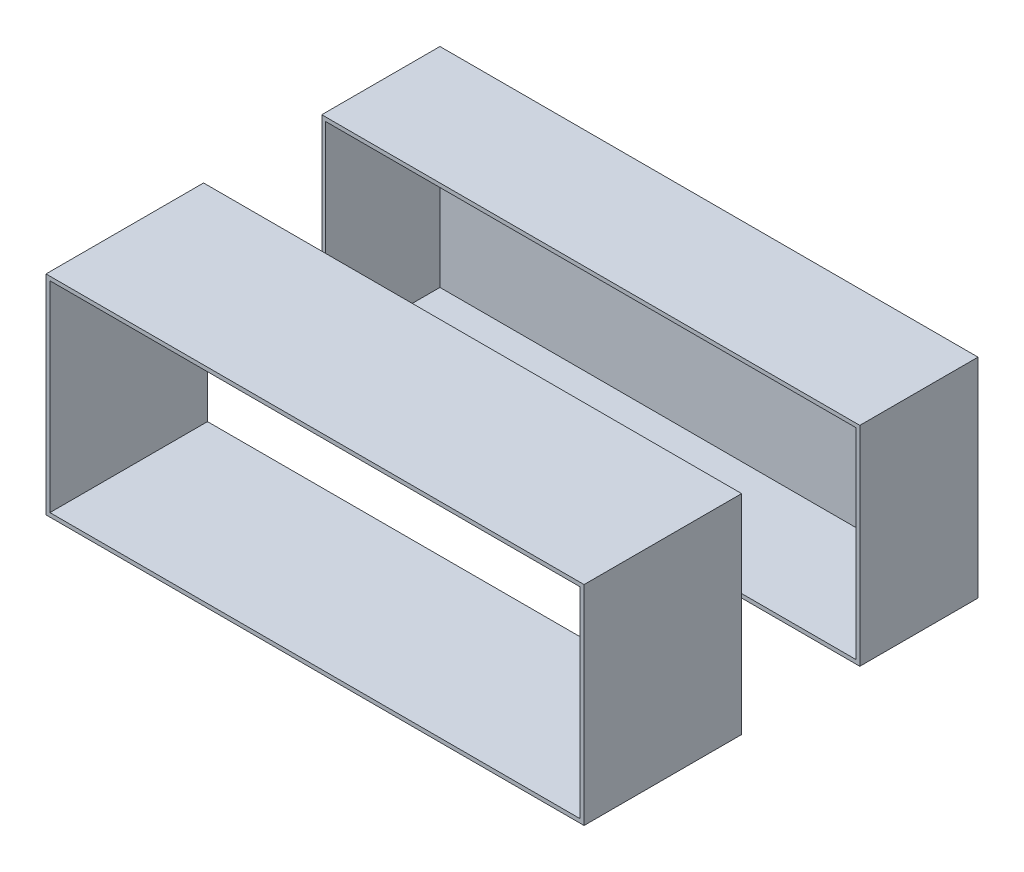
ISO-10303-21;
HEADER;
FILE_DESCRIPTION(('STEP AP214'),'2;1');
FILE_NAME('part.step','',(''),(''),'','','');
FILE_SCHEMA(('AUTOMOTIVE_DESIGN { 1 0 10303 214 1 1 1 1 }'));
ENDSEC;
DATA;
#1=APPLICATION_CONTEXT('core data for automotive mechanical design processes');
#2=APPLICATION_PROTOCOL_DEFINITION('international standard','automotive_design',2000,#1);
#3=PRODUCT_CONTEXT('',#1,'mechanical');
#4=PRODUCT('Part','Part','',(#3));
#5=PRODUCT_RELATED_PRODUCT_CATEGORY('part','',(#4));
#6=PRODUCT_DEFINITION_FORMATION('','',#4);
#7=PRODUCT_DEFINITION_CONTEXT('part definition',#1,'design');
#8=PRODUCT_DEFINITION('design','',#6,#7);
#9=PRODUCT_DEFINITION_SHAPE('','',#8);
#10=(LENGTH_UNIT() NAMED_UNIT(*) SI_UNIT(.MILLI.,.METRE.));
#11=(NAMED_UNIT(*) PLANE_ANGLE_UNIT() SI_UNIT($,.RADIAN.));
#12=(NAMED_UNIT(*) SI_UNIT($,.STERADIAN.) SOLID_ANGLE_UNIT());
#13=UNCERTAINTY_MEASURE_WITH_UNIT(LENGTH_MEASURE(1.E-05),#10,'distance_accuracy_value','');
#14=(GEOMETRIC_REPRESENTATION_CONTEXT(3) GLOBAL_UNCERTAINTY_ASSIGNED_CONTEXT((#13)) GLOBAL_UNIT_ASSIGNED_CONTEXT((#10,
#11,#12)) REPRESENTATION_CONTEXT('',''));
#15=CARTESIAN_POINT('',(0.,0.,0.));
#16=DIRECTION('',(0.,0.,1.));
#17=DIRECTION('',(1.,0.,0.));
#18=AXIS2_PLACEMENT_3D('',#15,#16,#17);
#19=CARTESIAN_POINT('',(0.,0.,150.));
#20=DIRECTION('',(0.,0.,1.));
#21=DIRECTION('',(1.,0.,0.));
#22=AXIS2_PLACEMENT_3D('',#19,#20,#21);
#23=PLANE('',#22);
#24=DIRECTION('',(-1.,0.,0.));
#25=VECTOR('',#24,1.);
#26=CARTESIAN_POINT('',(0.,264.855941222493,150.));
#27=LINE('',#26,#25);
#28=CARTESIAN_POINT('',(682.910087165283,264.855941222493,150.));
#29=VERTEX_POINT('',#28);
#30=CARTESIAN_POINT('',(0.,264.855941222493,150.));
#31=VERTEX_POINT('',#30);
#32=EDGE_CURVE('E111',#29,#31,#27,.T.);
#33=ORIENTED_EDGE('',*,*,#32,.T.);
#34=DIRECTION('',(0.,-1.,0.));
#35=VECTOR('',#34,1.);
#36=CARTESIAN_POINT('',(0.,0.,150.));
#37=LINE('',#36,#35);
#38=CARTESIAN_POINT('',(0.,0.,150.));
#39=VERTEX_POINT('',#38);
#40=EDGE_CURVE('E120',#31,#39,#37,.T.);
#41=ORIENTED_EDGE('',*,*,#40,.T.);
#42=DIRECTION('',(1.,0.,0.));
#43=VECTOR('',#42,1.);
#44=CARTESIAN_POINT('',(0.,0.,150.));
#45=LINE('',#44,#43);
#46=CARTESIAN_POINT('',(682.910087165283,0.,150.));
#47=VERTEX_POINT('',#46);
#48=EDGE_CURVE('E126',#39,#47,#45,.T.);
#49=ORIENTED_EDGE('',*,*,#48,.T.);
#50=DIRECTION('',(0.,1.,0.));
#51=VECTOR('',#50,1.);
#52=CARTESIAN_POINT('',(682.910087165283,0.,150.));
#53=LINE('',#52,#51);
#54=EDGE_CURVE('E131',#47,#29,#53,.T.);
#55=ORIENTED_EDGE('',*,*,#54,.T.);
#56=EDGE_LOOP('',(#33,#41,#49,#55));
#57=FACE_BOUND('',#56,.T.);
#58=DIRECTION('',(0.,-1.,0.));
#59=VECTOR('',#58,1.);
#60=CARTESIAN_POINT('',(5.,0.,150.));
#61=LINE('',#60,#59);
#62=CARTESIAN_POINT('',(5.,259.855941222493,150.));
#63=VERTEX_POINT('',#62);
#64=CARTESIAN_POINT('',(5.,5.,150.));
#65=VERTEX_POINT('',#64);
#66=EDGE_CURVE('E125',#63,#65,#61,.T.);
#67=ORIENTED_EDGE('',*,*,#66,.F.);
#68=DIRECTION('',(-1.,0.,0.));
#69=VECTOR('',#68,1.);
#70=CARTESIAN_POINT('',(0.,259.855941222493,150.));
#71=LINE('',#70,#69);
#72=CARTESIAN_POINT('',(677.910087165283,259.855941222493,150.));
#73=VERTEX_POINT('',#72);
#74=EDGE_CURVE('E149',#73,#63,#71,.T.);
#75=ORIENTED_EDGE('',*,*,#74,.F.);
#76=DIRECTION('',(0.,1.,0.));
#77=VECTOR('',#76,1.);
#78=CARTESIAN_POINT('',(677.910087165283,0.,150.));
#79=LINE('',#78,#77);
#80=CARTESIAN_POINT('',(677.910087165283,5.,150.));
#81=VERTEX_POINT('',#80);
#82=EDGE_CURVE('E152',#81,#73,#79,.T.);
#83=ORIENTED_EDGE('',*,*,#82,.F.);
#84=DIRECTION('',(1.,0.,0.));
#85=VECTOR('',#84,1.);
#86=CARTESIAN_POINT('',(0.,5.,150.));
#87=LINE('',#86,#85);
#88=EDGE_CURVE('E158',#65,#81,#87,.T.);
#89=ORIENTED_EDGE('',*,*,#88,.F.);
#90=EDGE_LOOP('',(#67,#75,#83,#89));
#91=FACE_BOUND('',#90,.T.);
#92=ADVANCED_FACE('F43',(#57,#91),#23,.T.);
#93=CARTESIAN_POINT('',(0.,5.,500.));
#94=DIRECTION('',(0.,1.,0.));
#95=DIRECTION('',(0.,0.,1.));
#96=AXIS2_PLACEMENT_3D('',#93,#94,#95);
#97=PLANE('',#96);
#98=DIRECTION('',(0.,0.,-1.));
#99=VECTOR('',#98,1.);
#100=CARTESIAN_POINT('',(5.,5.,500.));
#101=LINE('',#100,#99);
#102=CARTESIAN_POINT('',(5.,5.,5.));
#103=VERTEX_POINT('',#102);
#104=EDGE_CURVE('E60',#65,#103,#101,.T.);
#105=ORIENTED_EDGE('',*,*,#104,.F.);
#106=ORIENTED_EDGE('',*,*,#88,.T.);
#107=DIRECTION('',(0.,0.,-1.));
#108=VECTOR('',#107,1.);
#109=CARTESIAN_POINT('',(677.910087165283,5.,500.));
#110=LINE('',#109,#108);
#111=CARTESIAN_POINT('',(677.910087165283,5.,5.));
#112=VERTEX_POINT('',#111);
#113=EDGE_CURVE('E141',#81,#112,#110,.T.);
#114=ORIENTED_EDGE('',*,*,#113,.T.);
#115=DIRECTION('',(1.,0.,0.));
#116=VECTOR('',#115,1.);
#117=CARTESIAN_POINT('',(0.,5.,5.));
#118=LINE('',#117,#116);
#119=EDGE_CURVE('E53',#103,#112,#118,.T.);
#120=ORIENTED_EDGE('',*,*,#119,.F.);
#121=EDGE_LOOP('',(#105,#106,#114,#120));
#122=FACE_BOUND('',#121,.T.);
#123=ADVANCED_FACE('F191',(#122),#97,.T.);
#124=CARTESIAN_POINT('',(0.,264.855941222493,5.));
#125=DIRECTION('',(0.,0.,-1.));
#126=DIRECTION('',(-1.,0.,0.));
#127=AXIS2_PLACEMENT_3D('',#124,#125,#126);
#128=PLANE('',#127);
#129=DIRECTION('',(0.,-1.,0.));
#130=VECTOR('',#129,1.);
#131=CARTESIAN_POINT('',(5.,264.855941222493,5.));
#132=LINE('',#131,#130);
#133=CARTESIAN_POINT('',(5.,259.855941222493,5.));
#134=VERTEX_POINT('',#133);
#135=EDGE_CURVE('E12',#134,#103,#132,.T.);
#136=ORIENTED_EDGE('',*,*,#135,.T.);
#137=ORIENTED_EDGE('',*,*,#119,.T.);
#138=DIRECTION('',(0.,1.,0.));
#139=VECTOR('',#138,1.);
#140=CARTESIAN_POINT('',(677.910087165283,264.855941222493,5.));
#141=LINE('',#140,#139);
#142=CARTESIAN_POINT('',(677.910087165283,259.855941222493,5.));
#143=VERTEX_POINT('',#142);
#144=EDGE_CURVE('E177',#112,#143,#141,.T.);
#145=ORIENTED_EDGE('',*,*,#144,.T.);
#146=DIRECTION('',(-1.,0.,0.));
#147=VECTOR('',#146,1.);
#148=CARTESIAN_POINT('',(0.,259.855941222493,5.));
#149=LINE('',#148,#147);
#150=EDGE_CURVE('E138',#143,#134,#149,.T.);
#151=ORIENTED_EDGE('',*,*,#150,.T.);
#152=EDGE_LOOP('',(#136,#137,#145,#151));
#153=FACE_BOUND('',#152,.T.);
#154=ADVANCED_FACE('F182',(#153),#128,.F.);
#155=CARTESIAN_POINT('',(5.,0.,500.));
#156=DIRECTION('',(1.,0.,0.));
#157=DIRECTION('',(0.,0.,-1.));
#158=AXIS2_PLACEMENT_3D('',#155,#156,#157);
#159=PLANE('',#158);
#160=DIRECTION('',(0.,0.,-1.));
#161=VECTOR('',#160,1.);
#162=CARTESIAN_POINT('',(5.,259.855941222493,500.));
#163=LINE('',#162,#161);
#164=EDGE_CURVE('E136',#63,#134,#163,.T.);
#165=ORIENTED_EDGE('',*,*,#164,.F.);
#166=ORIENTED_EDGE('',*,*,#66,.T.);
#167=ORIENTED_EDGE('',*,*,#104,.T.);
#168=ORIENTED_EDGE('',*,*,#135,.F.);
#169=EDGE_LOOP('',(#165,#166,#167,#168));
#170=FACE_BOUND('',#169,.T.);
#171=ADVANCED_FACE('F190',(#170),#159,.T.);
#172=CARTESIAN_POINT('',(677.910087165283,0.,500.));
#173=DIRECTION('',(-1.,0.,0.));
#174=DIRECTION('',(0.,0.,1.));
#175=AXIS2_PLACEMENT_3D('',#172,#173,#174);
#176=PLANE('',#175);
#177=ORIENTED_EDGE('',*,*,#113,.F.);
#178=ORIENTED_EDGE('',*,*,#82,.T.);
#179=DIRECTION('',(0.,0.,-1.));
#180=VECTOR('',#179,1.);
#181=CARTESIAN_POINT('',(677.910087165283,259.855941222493,500.));
#182=LINE('',#181,#180);
#183=EDGE_CURVE('E139',#73,#143,#182,.T.);
#184=ORIENTED_EDGE('',*,*,#183,.T.);
#185=ORIENTED_EDGE('',*,*,#144,.F.);
#186=EDGE_LOOP('',(#177,#178,#184,#185));
#187=FACE_BOUND('',#186,.T.);
#188=ADVANCED_FACE('F187',(#187),#176,.T.);
#189=CARTESIAN_POINT('',(0.,259.855941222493,500.));
#190=DIRECTION('',(0.,-1.,0.));
#191=DIRECTION('',(0.,0.,-1.));
#192=AXIS2_PLACEMENT_3D('',#189,#190,#191);
#193=PLANE('',#192);
#194=ORIENTED_EDGE('',*,*,#183,.F.);
#195=ORIENTED_EDGE('',*,*,#74,.T.);
#196=ORIENTED_EDGE('',*,*,#164,.T.);
#197=ORIENTED_EDGE('',*,*,#150,.F.);
#198=EDGE_LOOP('',(#194,#195,#196,#197));
#199=FACE_BOUND('',#198,.T.);
#200=ADVANCED_FACE('F188',(#199),#193,.T.);
#201=CARTESIAN_POINT('',(0.,0.,500.));
#202=DIRECTION('',(1.,0.,0.));
#203=DIRECTION('',(0.,0.,-1.));
#204=AXIS2_PLACEMENT_3D('',#201,#202,#203);
#205=PLANE('',#204);
#206=ORIENTED_EDGE('',*,*,#40,.F.);
#207=DIRECTION('',(0.,0.,-1.));
#208=VECTOR('',#207,1.);
#209=CARTESIAN_POINT('',(0.,264.855941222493,500.));
#210=LINE('',#209,#208);
#211=CARTESIAN_POINT('',(0.,264.855941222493,0.));
#212=VERTEX_POINT('',#211);
#213=EDGE_CURVE('E108',#31,#212,#210,.T.);
#214=ORIENTED_EDGE('',*,*,#213,.T.);
#215=DIRECTION('',(0.,-1.,0.));
#216=VECTOR('',#215,1.);
#217=CARTESIAN_POINT('',(0.,0.,0.));
#218=LINE('',#217,#216);
#219=CARTESIAN_POINT('',(0.,0.,0.));
#220=VERTEX_POINT('',#219);
#221=EDGE_CURVE('E143',#212,#220,#218,.T.);
#222=ORIENTED_EDGE('',*,*,#221,.T.);
#223=DIRECTION('',(0.,0.,-1.));
#224=VECTOR('',#223,1.);
#225=CARTESIAN_POINT('',(0.,0.,500.));
#226=LINE('',#225,#224);
#227=EDGE_CURVE('E47',#39,#220,#226,.T.);
#228=ORIENTED_EDGE('',*,*,#227,.F.);
#229=EDGE_LOOP('',(#206,#214,#222,#228));
#230=FACE_BOUND('',#229,.T.);
#231=ADVANCED_FACE('F121',(#230),#205,.F.);
#232=CARTESIAN_POINT('',(0.,0.,500.));
#233=DIRECTION('',(0.,1.,0.));
#234=DIRECTION('',(0.,0.,1.));
#235=AXIS2_PLACEMENT_3D('',#232,#233,#234);
#236=PLANE('',#235);
#237=ORIENTED_EDGE('',*,*,#48,.F.);
#238=ORIENTED_EDGE('',*,*,#227,.T.);
#239=DIRECTION('',(1.,0.,0.));
#240=VECTOR('',#239,1.);
#241=CARTESIAN_POINT('',(0.,0.,0.));
#242=LINE('',#241,#240);
#243=CARTESIAN_POINT('',(682.910087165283,0.,0.));
#244=VERTEX_POINT('',#243);
#245=EDGE_CURVE('E168',#220,#244,#242,.T.);
#246=ORIENTED_EDGE('',*,*,#245,.T.);
#247=DIRECTION('',(0.,0.,-1.));
#248=VECTOR('',#247,1.);
#249=CARTESIAN_POINT('',(682.910087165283,0.,500.));
#250=LINE('',#249,#248);
#251=EDGE_CURVE('E145',#47,#244,#250,.T.);
#252=ORIENTED_EDGE('',*,*,#251,.F.);
#253=EDGE_LOOP('',(#237,#238,#246,#252));
#254=FACE_BOUND('',#253,.T.);
#255=ADVANCED_FACE('F218',(#254),#236,.F.);
#256=CARTESIAN_POINT('',(682.910087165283,0.,500.));
#257=DIRECTION('',(-1.,0.,0.));
#258=DIRECTION('',(0.,0.,1.));
#259=AXIS2_PLACEMENT_3D('',#256,#257,#258);
#260=PLANE('',#259);
#261=ORIENTED_EDGE('',*,*,#54,.F.);
#262=ORIENTED_EDGE('',*,*,#251,.T.);
#263=DIRECTION('',(0.,1.,0.));
#264=VECTOR('',#263,1.);
#265=CARTESIAN_POINT('',(682.910087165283,0.,0.));
#266=LINE('',#265,#264);
#267=CARTESIAN_POINT('',(682.910087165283,264.855941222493,0.));
#268=VERTEX_POINT('',#267);
#269=EDGE_CURVE('E166',#244,#268,#266,.T.);
#270=ORIENTED_EDGE('',*,*,#269,.T.);
#271=DIRECTION('',(0.,0.,-1.));
#272=VECTOR('',#271,1.);
#273=CARTESIAN_POINT('',(682.910087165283,264.855941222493,500.));
#274=LINE('',#273,#272);
#275=EDGE_CURVE('E117',#29,#268,#274,.T.);
#276=ORIENTED_EDGE('',*,*,#275,.F.);
#277=EDGE_LOOP('',(#261,#262,#270,#276));
#278=FACE_BOUND('',#277,.T.);
#279=ADVANCED_FACE('F164',(#278),#260,.F.);
#280=CARTESIAN_POINT('',(0.,264.855941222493,500.));
#281=DIRECTION('',(0.,-1.,0.));
#282=DIRECTION('',(0.,0.,-1.));
#283=AXIS2_PLACEMENT_3D('',#280,#281,#282);
#284=PLANE('',#283);
#285=ORIENTED_EDGE('',*,*,#32,.F.);
#286=ORIENTED_EDGE('',*,*,#275,.T.);
#287=DIRECTION('',(-1.,0.,0.));
#288=VECTOR('',#287,1.);
#289=CARTESIAN_POINT('',(0.,264.855941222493,0.));
#290=LINE('',#289,#288);
#291=EDGE_CURVE('E113',#268,#212,#290,.T.);
#292=ORIENTED_EDGE('',*,*,#291,.T.);
#293=ORIENTED_EDGE('',*,*,#213,.F.);
#294=EDGE_LOOP('',(#285,#286,#292,#293));
#295=FACE_BOUND('',#294,.T.);
#296=ADVANCED_FACE('F45',(#295),#284,.F.);
#297=CARTESIAN_POINT('',(0.,264.855941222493,0.));
#298=DIRECTION('',(0.,0.,-1.));
#299=DIRECTION('',(-1.,0.,0.));
#300=AXIS2_PLACEMENT_3D('',#297,#298,#299);
#301=PLANE('',#300);
#302=ORIENTED_EDGE('',*,*,#221,.F.);
#303=ORIENTED_EDGE('',*,*,#291,.F.);
#304=ORIENTED_EDGE('',*,*,#269,.F.);
#305=ORIENTED_EDGE('',*,*,#245,.F.);
#306=EDGE_LOOP('',(#302,#303,#304,#305));
#307=FACE_BOUND('',#306,.T.);
#308=ADVANCED_FACE('F170',(#307),#301,.T.);
#309=CLOSED_SHELL('',(#92,#123,#154,#171,#188,#200,#231,#255,#279,#296,#308));
#310=MANIFOLD_SOLID_BREP('B2',#309);
#311=CARTESIAN_POINT('',(0.,0.,300.));
#312=DIRECTION('',(0.,0.,1.));
#313=DIRECTION('',(1.,0.,0.));
#314=AXIS2_PLACEMENT_3D('',#311,#312,#313);
#315=PLANE('',#314);
#316=DIRECTION('',(0.,-1.,0.));
#317=VECTOR('',#316,1.);
#318=CARTESIAN_POINT('',(5.,0.,300.));
#319=LINE('',#318,#317);
#320=CARTESIAN_POINT('',(5.,259.855941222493,300.));
#321=VERTEX_POINT('',#320);
#322=CARTESIAN_POINT('',(5.,5.,300.));
#323=VERTEX_POINT('',#322);
#324=EDGE_CURVE('E390',#321,#323,#319,.T.);
#325=ORIENTED_EDGE('',*,*,#324,.T.);
#326=DIRECTION('',(1.,0.,0.));
#327=VECTOR('',#326,1.);
#328=CARTESIAN_POINT('',(0.,5.,300.));
#329=LINE('',#328,#327);
#330=CARTESIAN_POINT('',(677.910087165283,5.,300.));
#331=VERTEX_POINT('',#330);
#332=EDGE_CURVE('E361',#323,#331,#329,.T.);
#333=ORIENTED_EDGE('',*,*,#332,.T.);
#334=DIRECTION('',(0.,1.,0.));
#335=VECTOR('',#334,1.);
#336=CARTESIAN_POINT('',(677.910087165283,0.,300.));
#337=LINE('',#336,#335);
#338=CARTESIAN_POINT('',(677.910087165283,259.855941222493,300.));
#339=VERTEX_POINT('',#338);
#340=EDGE_CURVE('E357',#331,#339,#337,.T.);
#341=ORIENTED_EDGE('',*,*,#340,.T.);
#342=DIRECTION('',(-1.,0.,0.));
#343=VECTOR('',#342,1.);
#344=CARTESIAN_POINT('',(0.,259.855941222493,300.));
#345=LINE('',#344,#343);
#346=EDGE_CURVE('E348',#339,#321,#345,.T.);
#347=ORIENTED_EDGE('',*,*,#346,.T.);
#348=EDGE_LOOP('',(#325,#333,#341,#347));
#349=FACE_BOUND('',#348,.T.);
#350=DIRECTION('',(-1.,0.,0.));
#351=VECTOR('',#350,1.);
#352=CARTESIAN_POINT('',(0.,264.855941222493,300.));
#353=LINE('',#352,#351);
#354=CARTESIAN_POINT('',(682.910087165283,264.855941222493,300.));
#355=VERTEX_POINT('',#354);
#356=CARTESIAN_POINT('',(0.,264.855941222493,300.));
#357=VERTEX_POINT('',#356);
#358=EDGE_CURVE('E387',#355,#357,#353,.T.);
#359=ORIENTED_EDGE('',*,*,#358,.F.);
#360=DIRECTION('',(0.,1.,0.));
#361=VECTOR('',#360,1.);
#362=CARTESIAN_POINT('',(682.910087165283,0.,300.));
#363=LINE('',#362,#361);
#364=CARTESIAN_POINT('',(682.910087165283,0.,300.));
#365=VERTEX_POINT('',#364);
#366=EDGE_CURVE('E396',#365,#355,#363,.T.);
#367=ORIENTED_EDGE('',*,*,#366,.F.);
#368=DIRECTION('',(1.,0.,0.));
#369=VECTOR('',#368,1.);
#370=CARTESIAN_POINT('',(0.,0.,300.));
#371=LINE('',#370,#369);
#372=CARTESIAN_POINT('',(0.,0.,300.));
#373=VERTEX_POINT('',#372);
#374=EDGE_CURVE('E394',#373,#365,#371,.T.);
#375=ORIENTED_EDGE('',*,*,#374,.F.);
#376=DIRECTION('',(0.,-1.,0.));
#377=VECTOR('',#376,1.);
#378=CARTESIAN_POINT('',(0.,0.,300.));
#379=LINE('',#378,#377);
#380=EDGE_CURVE('E392',#357,#373,#379,.T.);
#381=ORIENTED_EDGE('',*,*,#380,.F.);
#382=EDGE_LOOP('',(#359,#367,#375,#381));
#383=FACE_BOUND('',#382,.T.);
#384=ADVANCED_FACE('F282',(#349,#383),#315,.F.);
#385=CARTESIAN_POINT('',(0.,0.,500.));
#386=DIRECTION('',(0.,1.,0.));
#387=DIRECTION('',(0.,0.,1.));
#388=AXIS2_PLACEMENT_3D('',#385,#386,#387);
#389=PLANE('',#388);
#390=DIRECTION('',(0.,0.,-1.));
#391=VECTOR('',#390,1.);
#392=CARTESIAN_POINT('',(0.,0.,500.));
#393=LINE('',#392,#391);
#394=CARTESIAN_POINT('',(0.,0.,500.));
#395=VERTEX_POINT('',#394);
#396=EDGE_CURVE('E385',#395,#373,#393,.T.);
#397=ORIENTED_EDGE('',*,*,#396,.T.);
#398=ORIENTED_EDGE('',*,*,#374,.T.);
#399=DIRECTION('',(0.,0.,-1.));
#400=VECTOR('',#399,1.);
#401=CARTESIAN_POINT('',(682.910087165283,0.,500.));
#402=LINE('',#401,#400);
#403=CARTESIAN_POINT('',(682.910087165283,0.,500.));
#404=VERTEX_POINT('',#403);
#405=EDGE_CURVE('E382',#404,#365,#402,.T.);
#406=ORIENTED_EDGE('',*,*,#405,.F.);
#407=DIRECTION('',(1.,0.,0.));
#408=VECTOR('',#407,1.);
#409=CARTESIAN_POINT('',(0.,0.,500.));
#410=LINE('',#409,#408);
#411=EDGE_CURVE('E405',#395,#404,#410,.T.);
#412=ORIENTED_EDGE('',*,*,#411,.F.);
#413=EDGE_LOOP('',(#397,#398,#406,#412));
#414=FACE_BOUND('',#413,.T.);
#415=ADVANCED_FACE('F424',(#414),#389,.F.);
#416=CARTESIAN_POINT('',(0.,5.,500.));
#417=DIRECTION('',(0.,1.,0.));
#418=DIRECTION('',(0.,0.,1.));
#419=AXIS2_PLACEMENT_3D('',#416,#417,#418);
#420=PLANE('',#419);
#421=ORIENTED_EDGE('',*,*,#332,.F.);
#422=DIRECTION('',(0.,0.,-1.));
#423=VECTOR('',#422,1.);
#424=CARTESIAN_POINT('',(5.,5.,500.));
#425=LINE('',#424,#423);
#426=CARTESIAN_POINT('',(5.,5.,500.));
#427=VERTEX_POINT('',#426);
#428=EDGE_CURVE('E370',#427,#323,#425,.T.);
#429=ORIENTED_EDGE('',*,*,#428,.F.);
#430=DIRECTION('',(1.,0.,0.));
#431=VECTOR('',#430,1.);
#432=CARTESIAN_POINT('',(0.,5.,500.));
#433=LINE('',#432,#431);
#434=CARTESIAN_POINT('',(677.910087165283,5.,500.));
#435=VERTEX_POINT('',#434);
#436=EDGE_CURVE('E291',#427,#435,#433,.T.);
#437=ORIENTED_EDGE('',*,*,#436,.T.);
#438=DIRECTION('',(0.,0.,-1.));
#439=VECTOR('',#438,1.);
#440=CARTESIAN_POINT('',(677.910087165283,5.,500.));
#441=LINE('',#440,#439);
#442=EDGE_CURVE('E368',#435,#331,#441,.T.);
#443=ORIENTED_EDGE('',*,*,#442,.T.);
#444=EDGE_LOOP('',(#421,#429,#437,#443));
#445=FACE_BOUND('',#444,.T.);
#446=ADVANCED_FACE('F434',(#445),#420,.T.);
#447=CARTESIAN_POINT('',(5.,0.,500.));
#448=DIRECTION('',(1.,0.,0.));
#449=DIRECTION('',(0.,0.,-1.));
#450=AXIS2_PLACEMENT_3D('',#447,#448,#449);
#451=PLANE('',#450);
#452=ORIENTED_EDGE('',*,*,#324,.F.);
#453=DIRECTION('',(0.,0.,-1.));
#454=VECTOR('',#453,1.);
#455=CARTESIAN_POINT('',(5.,259.855941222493,500.));
#456=LINE('',#455,#454);
#457=CARTESIAN_POINT('',(5.,259.855941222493,500.));
#458=VERTEX_POINT('',#457);
#459=EDGE_CURVE('E286',#458,#321,#456,.T.);
#460=ORIENTED_EDGE('',*,*,#459,.F.);
#461=DIRECTION('',(0.,-1.,0.));
#462=VECTOR('',#461,1.);
#463=CARTESIAN_POINT('',(5.,264.855941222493,500.));
#464=LINE('',#463,#462);
#465=EDGE_CURVE('E41',#458,#427,#464,.T.);
#466=ORIENTED_EDGE('',*,*,#465,.T.);
#467=ORIENTED_EDGE('',*,*,#428,.T.);
#468=EDGE_LOOP('',(#452,#460,#466,#467));
#469=FACE_BOUND('',#468,.T.);
#470=ADVANCED_FACE('F451',(#469),#451,.T.);
#471=CARTESIAN_POINT('',(0.,264.855941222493,500.));
#472=DIRECTION('',(0.,0.,-1.));
#473=DIRECTION('',(-1.,0.,0.));
#474=AXIS2_PLACEMENT_3D('',#471,#472,#473);
#475=PLANE('',#474);
#476=DIRECTION('',(0.,-1.,0.));
#477=VECTOR('',#476,1.);
#478=CARTESIAN_POINT('',(0.,0.,500.));
#479=LINE('',#478,#477);
#480=CARTESIAN_POINT('',(0.,264.855941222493,500.));
#481=VERTEX_POINT('',#480);
#482=EDGE_CURVE('E374',#481,#395,#479,.T.);
#483=ORIENTED_EDGE('',*,*,#482,.T.);
#484=ORIENTED_EDGE('',*,*,#411,.T.);
#485=DIRECTION('',(0.,1.,0.));
#486=VECTOR('',#485,1.);
#487=CARTESIAN_POINT('',(682.910087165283,0.,500.));
#488=LINE('',#487,#486);
#489=CARTESIAN_POINT('',(682.910087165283,264.855941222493,500.));
#490=VERTEX_POINT('',#489);
#491=EDGE_CURVE('E407',#404,#490,#488,.T.);
#492=ORIENTED_EDGE('',*,*,#491,.T.);
#493=DIRECTION('',(-1.,0.,0.));
#494=VECTOR('',#493,1.);
#495=CARTESIAN_POINT('',(0.,264.855941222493,500.));
#496=LINE('',#495,#494);
#497=EDGE_CURVE('E378',#490,#481,#496,.T.);
#498=ORIENTED_EDGE('',*,*,#497,.T.);
#499=EDGE_LOOP('',(#483,#484,#492,#498));
#500=FACE_BOUND('',#499,.T.);
#501=ORIENTED_EDGE('',*,*,#465,.F.);
#502=DIRECTION('',(-1.,0.,0.));
#503=VECTOR('',#502,1.);
#504=CARTESIAN_POINT('',(0.,259.855941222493,500.));
#505=LINE('',#504,#503);
#506=CARTESIAN_POINT('',(677.910087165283,259.855941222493,500.));
#507=VERTEX_POINT('',#506);
#508=EDGE_CURVE('E369',#507,#458,#505,.T.);
#509=ORIENTED_EDGE('',*,*,#508,.F.);
#510=DIRECTION('',(0.,1.,0.));
#511=VECTOR('',#510,1.);
#512=CARTESIAN_POINT('',(677.910087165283,264.855941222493,500.));
#513=LINE('',#512,#511);
#514=EDGE_CURVE('E366',#435,#507,#513,.T.);
#515=ORIENTED_EDGE('',*,*,#514,.F.);
#516=ORIENTED_EDGE('',*,*,#436,.F.);
#517=EDGE_LOOP('',(#501,#509,#515,#516));
#518=FACE_BOUND('',#517,.T.);
#519=ADVANCED_FACE('F412',(#500,#518),#475,.F.);
#520=CARTESIAN_POINT('',(677.910087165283,0.,500.));
#521=DIRECTION('',(-1.,0.,0.));
#522=DIRECTION('',(0.,0.,1.));
#523=AXIS2_PLACEMENT_3D('',#520,#521,#522);
#524=PLANE('',#523);
#525=ORIENTED_EDGE('',*,*,#340,.F.);
#526=ORIENTED_EDGE('',*,*,#442,.F.);
#527=ORIENTED_EDGE('',*,*,#514,.T.);
#528=DIRECTION('',(0.,0.,-1.));
#529=VECTOR('',#528,1.);
#530=CARTESIAN_POINT('',(677.910087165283,259.855941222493,500.));
#531=LINE('',#530,#529);
#532=EDGE_CURVE('E352',#507,#339,#531,.T.);
#533=ORIENTED_EDGE('',*,*,#532,.T.);
#534=EDGE_LOOP('',(#525,#526,#527,#533));
#535=FACE_BOUND('',#534,.T.);
#536=ADVANCED_FACE('F364',(#535),#524,.T.);
#537=CARTESIAN_POINT('',(0.,259.855941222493,500.));
#538=DIRECTION('',(0.,-1.,0.));
#539=DIRECTION('',(0.,0.,-1.));
#540=AXIS2_PLACEMENT_3D('',#537,#538,#539);
#541=PLANE('',#540);
#542=ORIENTED_EDGE('',*,*,#346,.F.);
#543=ORIENTED_EDGE('',*,*,#532,.F.);
#544=ORIENTED_EDGE('',*,*,#508,.T.);
#545=ORIENTED_EDGE('',*,*,#459,.T.);
#546=EDGE_LOOP('',(#542,#543,#544,#545));
#547=FACE_BOUND('',#546,.T.);
#548=ADVANCED_FACE('F350',(#547),#541,.T.);
#549=CARTESIAN_POINT('',(0.,0.,500.));
#550=DIRECTION('',(1.,0.,0.));
#551=DIRECTION('',(0.,0.,-1.));
#552=AXIS2_PLACEMENT_3D('',#549,#550,#551);
#553=PLANE('',#552);
#554=DIRECTION('',(0.,0.,-1.));
#555=VECTOR('',#554,1.);
#556=CARTESIAN_POINT('',(0.,264.855941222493,500.));
#557=LINE('',#556,#555);
#558=EDGE_CURVE('E375',#481,#357,#557,.T.);
#559=ORIENTED_EDGE('',*,*,#558,.T.);
#560=ORIENTED_EDGE('',*,*,#380,.T.);
#561=ORIENTED_EDGE('',*,*,#396,.F.);
#562=ORIENTED_EDGE('',*,*,#482,.F.);
#563=EDGE_LOOP('',(#559,#560,#561,#562));
#564=FACE_BOUND('',#563,.T.);
#565=ADVANCED_FACE('F421',(#564),#553,.F.);
#566=CARTESIAN_POINT('',(682.910087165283,0.,500.));
#567=DIRECTION('',(-1.,0.,0.));
#568=DIRECTION('',(0.,0.,1.));
#569=AXIS2_PLACEMENT_3D('',#566,#567,#568);
#570=PLANE('',#569);
#571=ORIENTED_EDGE('',*,*,#405,.T.);
#572=ORIENTED_EDGE('',*,*,#366,.T.);
#573=DIRECTION('',(0.,0.,-1.));
#574=VECTOR('',#573,1.);
#575=CARTESIAN_POINT('',(682.910087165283,264.855941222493,500.));
#576=LINE('',#575,#574);
#577=EDGE_CURVE('E379',#490,#355,#576,.T.);
#578=ORIENTED_EDGE('',*,*,#577,.F.);
#579=ORIENTED_EDGE('',*,*,#491,.F.);
#580=EDGE_LOOP('',(#571,#572,#578,#579));
#581=FACE_BOUND('',#580,.T.);
#582=ADVANCED_FACE('F428',(#581),#570,.F.);
#583=CARTESIAN_POINT('',(0.,264.855941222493,500.));
#584=DIRECTION('',(0.,-1.,0.));
#585=DIRECTION('',(0.,0.,-1.));
#586=AXIS2_PLACEMENT_3D('',#583,#584,#585);
#587=PLANE('',#586);
#588=ORIENTED_EDGE('',*,*,#577,.T.);
#589=ORIENTED_EDGE('',*,*,#358,.T.);
#590=ORIENTED_EDGE('',*,*,#558,.F.);
#591=ORIENTED_EDGE('',*,*,#497,.F.);
#592=EDGE_LOOP('',(#588,#589,#590,#591));
#593=FACE_BOUND('',#592,.T.);
#594=ADVANCED_FACE('F284',(#593),#587,.F.);
#595=CLOSED_SHELL('',(#384,#415,#446,#470,#519,#536,#548,#565,#582,#594));
#596=MANIFOLD_SOLID_BREP('B6',#595);
#597=ADVANCED_BREP_SHAPE_REPRESENTATION('',(#18,#310,#596),#14);
#598=SHAPE_DEFINITION_REPRESENTATION(#9,#597);
ENDSEC;
END-ISO-10303-21;
